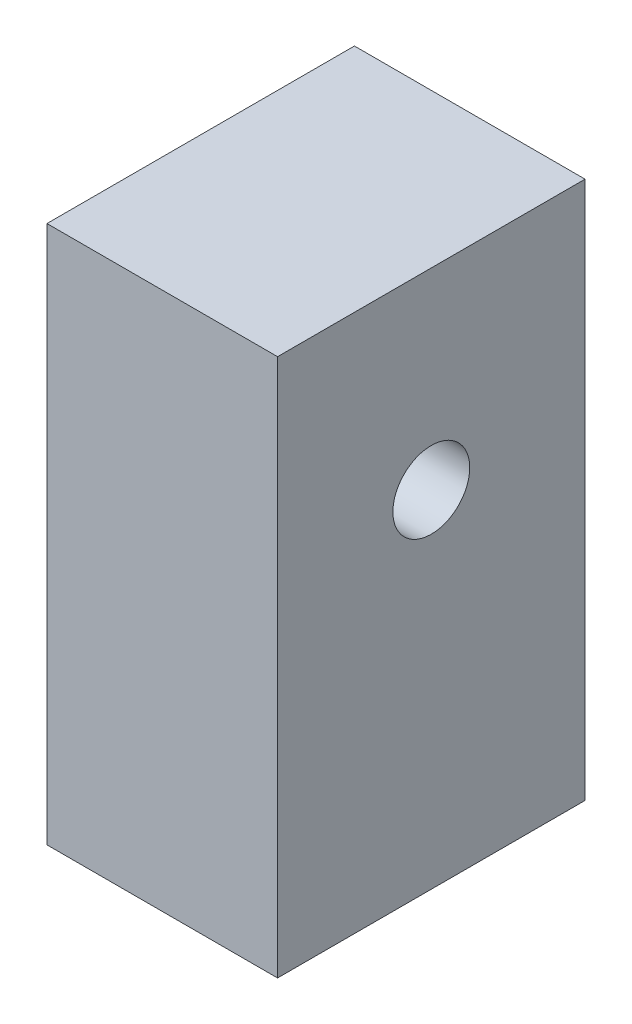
ISO-10303-21;
HEADER;
FILE_DESCRIPTION(('STEP AP214'),'2;1');
FILE_NAME('part.step','',(''),(''),'','','');
FILE_SCHEMA(('AUTOMOTIVE_DESIGN { 1 0 10303 214 1 1 1 1 }'));
ENDSEC;
DATA;
#1=APPLICATION_CONTEXT('core data for automotive mechanical design processes');
#2=APPLICATION_PROTOCOL_DEFINITION('international standard','automotive_design',2000,#1);
#3=PRODUCT_CONTEXT('',#1,'mechanical');
#4=PRODUCT('Part','Part','',(#3));
#5=PRODUCT_RELATED_PRODUCT_CATEGORY('part','',(#4));
#6=PRODUCT_DEFINITION_FORMATION('','',#4);
#7=PRODUCT_DEFINITION_CONTEXT('part definition',#1,'design');
#8=PRODUCT_DEFINITION('design','',#6,#7);
#9=PRODUCT_DEFINITION_SHAPE('','',#8);
#10=(LENGTH_UNIT() NAMED_UNIT(*) SI_UNIT(.MILLI.,.METRE.));
#11=(NAMED_UNIT(*) PLANE_ANGLE_UNIT() SI_UNIT($,.RADIAN.));
#12=(NAMED_UNIT(*) SI_UNIT($,.STERADIAN.) SOLID_ANGLE_UNIT());
#13=UNCERTAINTY_MEASURE_WITH_UNIT(LENGTH_MEASURE(1.E-05),#10,'distance_accuracy_value','');
#14=(GEOMETRIC_REPRESENTATION_CONTEXT(3) GLOBAL_UNCERTAINTY_ASSIGNED_CONTEXT((#13)) GLOBAL_UNIT_ASSIGNED_CONTEXT((#10,
#11,#12)) REPRESENTATION_CONTEXT('',''));
#15=CARTESIAN_POINT('',(0.,0.,0.));
#16=DIRECTION('',(0.,0.,1.));
#17=DIRECTION('',(1.,0.,0.));
#18=AXIS2_PLACEMENT_3D('',#15,#16,#17);
#19=CARTESIAN_POINT('',(9.525,22.225,-12.7));
#20=DIRECTION('',(0.,0.,1.));
#21=DIRECTION('',(0.,-1.,0.));
#22=AXIS2_PLACEMENT_3D('',#19,#20,#21);
#23=PLANE('',#22);
#24=DIRECTION('',(0.,1.,0.));
#25=VECTOR('',#24,1.);
#26=CARTESIAN_POINT('',(-9.525,22.225,-12.7));
#27=LINE('',#26,#25);
#28=CARTESIAN_POINT('',(-9.525,-22.225,-12.7));
#29=VERTEX_POINT('',#28);
#30=CARTESIAN_POINT('',(-9.525,22.225,-12.7));
#31=VERTEX_POINT('',#30);
#32=EDGE_CURVE('E118',#29,#31,#27,.T.);
#33=ORIENTED_EDGE('',*,*,#32,.T.);
#34=DIRECTION('',(-1.,0.,0.));
#35=VECTOR('',#34,1.);
#36=CARTESIAN_POINT('',(9.525,22.225,-12.7));
#37=LINE('',#36,#35);
#38=CARTESIAN_POINT('',(9.525,22.225,-12.7));
#39=VERTEX_POINT('',#38);
#40=EDGE_CURVE('E11',#39,#31,#37,.T.);
#41=ORIENTED_EDGE('',*,*,#40,.F.);
#42=DIRECTION('',(0.,1.,0.));
#43=VECTOR('',#42,1.);
#44=CARTESIAN_POINT('',(9.525,22.225,-12.7));
#45=LINE('',#44,#43);
#46=CARTESIAN_POINT('',(9.525,-22.225,-12.7));
#47=VERTEX_POINT('',#46);
#48=EDGE_CURVE('E119',#47,#39,#45,.T.);
#49=ORIENTED_EDGE('',*,*,#48,.F.);
#50=DIRECTION('',(-1.,0.,0.));
#51=VECTOR('',#50,1.);
#52=CARTESIAN_POINT('',(9.525,-22.225,-12.7));
#53=LINE('',#52,#51);
#54=EDGE_CURVE('E125',#47,#29,#53,.T.);
#55=ORIENTED_EDGE('',*,*,#54,.T.);
#56=EDGE_LOOP('',(#33,#41,#49,#55));
#57=FACE_BOUND('',#56,.T.);
#58=ADVANCED_FACE('F37',(#57),#23,.F.);
#59=CARTESIAN_POINT('',(9.525,22.225,12.7));
#60=DIRECTION('',(0.,-1.,0.));
#61=DIRECTION('',(0.,0.,-1.));
#62=AXIS2_PLACEMENT_3D('',#59,#60,#61);
#63=PLANE('',#62);
#64=DIRECTION('',(0.,0.,1.));
#65=VECTOR('',#64,1.);
#66=CARTESIAN_POINT('',(-9.525,22.225,12.7));
#67=LINE('',#66,#65);
#68=CARTESIAN_POINT('',(-9.525,22.225,12.7));
#69=VERTEX_POINT('',#68);
#70=EDGE_CURVE('E128',#31,#69,#67,.T.);
#71=ORIENTED_EDGE('',*,*,#70,.T.);
#72=DIRECTION('',(-1.,0.,0.));
#73=VECTOR('',#72,1.);
#74=CARTESIAN_POINT('',(9.525,22.225,12.7));
#75=LINE('',#74,#73);
#76=CARTESIAN_POINT('',(9.525,22.225,12.7));
#77=VERTEX_POINT('',#76);
#78=EDGE_CURVE('E45',#77,#69,#75,.T.);
#79=ORIENTED_EDGE('',*,*,#78,.F.);
#80=DIRECTION('',(0.,0.,1.));
#81=VECTOR('',#80,1.);
#82=CARTESIAN_POINT('',(9.525,22.225,12.7));
#83=LINE('',#82,#81);
#84=EDGE_CURVE('E84',#39,#77,#83,.T.);
#85=ORIENTED_EDGE('',*,*,#84,.F.);
#86=ORIENTED_EDGE('',*,*,#40,.T.);
#87=EDGE_LOOP('',(#71,#79,#85,#86));
#88=FACE_BOUND('',#87,.T.);
#89=ADVANCED_FACE('F155',(#88),#63,.F.);
#90=CARTESIAN_POINT('',(9.525,22.225,12.7));
#91=DIRECTION('',(0.,0.,-1.));
#92=DIRECTION('',(0.,1.,0.));
#93=AXIS2_PLACEMENT_3D('',#90,#91,#92);
#94=PLANE('',#93);
#95=DIRECTION('',(0.,-1.,0.));
#96=VECTOR('',#95,1.);
#97=CARTESIAN_POINT('',(-9.525,22.225,12.7));
#98=LINE('',#97,#96);
#99=CARTESIAN_POINT('',(-9.525,-22.225,12.7));
#100=VERTEX_POINT('',#99);
#101=EDGE_CURVE('E71',#69,#100,#98,.T.);
#102=ORIENTED_EDGE('',*,*,#101,.T.);
#103=DIRECTION('',(-1.,0.,0.));
#104=VECTOR('',#103,1.);
#105=CARTESIAN_POINT('',(9.525,-22.225,12.7));
#106=LINE('',#105,#104);
#107=CARTESIAN_POINT('',(9.525,-22.225,12.7));
#108=VERTEX_POINT('',#107);
#109=EDGE_CURVE('E133',#108,#100,#106,.T.);
#110=ORIENTED_EDGE('',*,*,#109,.F.);
#111=DIRECTION('',(0.,-1.,0.));
#112=VECTOR('',#111,1.);
#113=CARTESIAN_POINT('',(9.525,22.225,12.7));
#114=LINE('',#113,#112);
#115=EDGE_CURVE('E122',#77,#108,#114,.T.);
#116=ORIENTED_EDGE('',*,*,#115,.F.);
#117=ORIENTED_EDGE('',*,*,#78,.T.);
#118=EDGE_LOOP('',(#102,#110,#116,#117));
#119=FACE_BOUND('',#118,.T.);
#120=ADVANCED_FACE('F135',(#119),#94,.F.);
#121=CARTESIAN_POINT('',(9.525,-22.225,12.7));
#122=DIRECTION('',(0.,1.,0.));
#123=DIRECTION('',(0.,0.,1.));
#124=AXIS2_PLACEMENT_3D('',#121,#122,#123);
#125=PLANE('',#124);
#126=CARTESIAN_POINT('',(0.,-22.225,7.62));
#127=DIRECTION('',(0.,-1.,0.));
#128=DIRECTION('',(0.,0.,-1.));
#129=AXIS2_PLACEMENT_3D('',#126,#127,#128);
#130=CIRCLE('',#129,2.0193);
#131=CARTESIAN_POINT('',(0.,-22.225,5.6007));
#132=VERTEX_POINT('',#131);
#133=EDGE_CURVE('E102',#132,#132,#130,.T.);
#134=ORIENTED_EDGE('',*,*,#133,.F.);
#135=EDGE_LOOP('',(#134));
#136=FACE_BOUND('',#135,.T.);
#137=CARTESIAN_POINT('',(0.,-22.225,-7.62));
#138=DIRECTION('',(0.,-1.,0.));
#139=DIRECTION('',(0.,0.,-1.));
#140=AXIS2_PLACEMENT_3D('',#137,#138,#139);
#141=CIRCLE('',#140,2.0193);
#142=CARTESIAN_POINT('',(0.,-22.225,-9.6393));
#143=VERTEX_POINT('',#142);
#144=EDGE_CURVE('E101',#143,#143,#141,.T.);
#145=ORIENTED_EDGE('',*,*,#144,.F.);
#146=EDGE_LOOP('',(#145));
#147=FACE_BOUND('',#146,.T.);
#148=DIRECTION('',(0.,0.,-1.));
#149=VECTOR('',#148,1.);
#150=CARTESIAN_POINT('',(-9.525,-22.225,12.7));
#151=LINE('',#150,#149);
#152=EDGE_CURVE('E77',#100,#29,#151,.T.);
#153=ORIENTED_EDGE('',*,*,#152,.T.);
#154=ORIENTED_EDGE('',*,*,#54,.F.);
#155=DIRECTION('',(0.,0.,-1.));
#156=VECTOR('',#155,1.);
#157=CARTESIAN_POINT('',(9.525,-22.225,12.7));
#158=LINE('',#157,#156);
#159=EDGE_CURVE('E53',#108,#47,#158,.T.);
#160=ORIENTED_EDGE('',*,*,#159,.F.);
#161=ORIENTED_EDGE('',*,*,#109,.T.);
#162=EDGE_LOOP('',(#153,#154,#160,#161));
#163=FACE_BOUND('',#162,.T.);
#164=ADVANCED_FACE('F142',(#136,#147,#163),#125,.F.);
#165=CARTESIAN_POINT('',(9.525,0.,0.));
#166=DIRECTION('',(1.,0.,0.));
#167=DIRECTION('',(0.,0.,-1.));
#168=AXIS2_PLACEMENT_3D('',#165,#166,#167);
#169=PLANE('',#168);
#170=CARTESIAN_POINT('',(9.525,6.34999999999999,0.));
#171=DIRECTION('',(1.,0.,0.));
#172=DIRECTION('',(0.,0.,-1.));
#173=AXIS2_PLACEMENT_3D('',#170,#171,#172);
#174=CIRCLE('',#173,3.17499999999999);
#175=CARTESIAN_POINT('',(9.525,6.34999999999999,-3.17499999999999));
#176=VERTEX_POINT('',#175);
#177=EDGE_CURVE('E112',#176,#176,#174,.T.);
#178=ORIENTED_EDGE('',*,*,#177,.F.);
#179=EDGE_LOOP('',(#178));
#180=FACE_BOUND('',#179,.T.);
#181=ORIENTED_EDGE('',*,*,#48,.T.);
#182=ORIENTED_EDGE('',*,*,#84,.T.);
#183=ORIENTED_EDGE('',*,*,#115,.T.);
#184=ORIENTED_EDGE('',*,*,#159,.T.);
#185=EDGE_LOOP('',(#181,#182,#183,#184));
#186=FACE_BOUND('',#185,.T.);
#187=ADVANCED_FACE('F144',(#180,#186),#169,.T.);
#188=CARTESIAN_POINT('',(-9.525,0.,0.));
#189=DIRECTION('',(1.,0.,0.));
#190=DIRECTION('',(0.,0.,-1.));
#191=AXIS2_PLACEMENT_3D('',#188,#189,#190);
#192=PLANE('',#191);
#193=CARTESIAN_POINT('',(-9.525,6.34999999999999,0.));
#194=DIRECTION('',(1.,0.,0.));
#195=DIRECTION('',(0.,0.,-1.));
#196=AXIS2_PLACEMENT_3D('',#193,#194,#195);
#197=CIRCLE('',#196,3.175);
#198=CARTESIAN_POINT('',(-9.525,6.34999999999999,-3.175));
#199=VERTEX_POINT('',#198);
#200=EDGE_CURVE('E115',#199,#199,#197,.T.);
#201=ORIENTED_EDGE('',*,*,#200,.T.);
#202=EDGE_LOOP('',(#201));
#203=FACE_BOUND('',#202,.T.);
#204=ORIENTED_EDGE('',*,*,#32,.F.);
#205=ORIENTED_EDGE('',*,*,#152,.F.);
#206=ORIENTED_EDGE('',*,*,#101,.F.);
#207=ORIENTED_EDGE('',*,*,#70,.F.);
#208=EDGE_LOOP('',(#204,#205,#206,#207));
#209=FACE_BOUND('',#208,.T.);
#210=ADVANCED_FACE('F138',(#203,#209),#192,.F.);
#211=CARTESIAN_POINT('',(9.525,6.34999999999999,0.));
#212=DIRECTION('',(1.,0.,0.));
#213=DIRECTION('',(0.,0.,-1.));
#214=AXIS2_PLACEMENT_3D('',#211,#212,#213);
#215=CYLINDRICAL_SURFACE('',#214,3.17499999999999);
#216=ORIENTED_EDGE('',*,*,#200,.F.);
#217=EDGE_LOOP('',(#216));
#218=FACE_BOUND('',#217,.T.);
#219=ORIENTED_EDGE('',*,*,#177,.T.);
#220=EDGE_LOOP('',(#219));
#221=FACE_BOUND('',#220,.T.);
#222=ADVANCED_FACE('F187',(#218,#221),#215,.F.);
#223=CARTESIAN_POINT('',(0.,-10.1854,-7.62));
#224=DIRECTION('',(0.,-1.,0.));
#225=DIRECTION('',(0.,0.,-1.));
#226=AXIS2_PLACEMENT_3D('',#223,#224,#225);
#227=CONICAL_SURFACE('',#226,2.01929999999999,1.02974425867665);
#228=CARTESIAN_POINT('',(0.,-8.97208215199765,-7.62));
#229=VERTEX_POINT('',#228);
#230=VERTEX_LOOP('',#229);
#231=FACE_BOUND('',#230,.T.);
#232=CARTESIAN_POINT('',(0.,-10.1854,-7.62));
#233=DIRECTION('',(0.,-1.,0.));
#234=DIRECTION('',(0.,0.,-1.));
#235=AXIS2_PLACEMENT_3D('',#232,#233,#234);
#236=CIRCLE('',#235,2.01929999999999);
#237=CARTESIAN_POINT('',(0.,-10.1854,-9.6393));
#238=VERTEX_POINT('',#237);
#239=EDGE_CURVE('E105',#238,#238,#236,.T.);
#240=ORIENTED_EDGE('',*,*,#239,.T.);
#241=EDGE_LOOP('',(#240));
#242=FACE_BOUND('',#241,.T.);
#243=ADVANCED_FACE('F195',(#231,#242),#227,.F.);
#244=CARTESIAN_POINT('',(0.,-22.225,-7.62));
#245=DIRECTION('',(0.,-1.,0.));
#246=DIRECTION('',(0.,0.,-1.));
#247=AXIS2_PLACEMENT_3D('',#244,#245,#246);
#248=CYLINDRICAL_SURFACE('',#247,2.0193);
#249=ORIENTED_EDGE('',*,*,#239,.F.);
#250=EDGE_LOOP('',(#249));
#251=FACE_BOUND('',#250,.T.);
#252=ORIENTED_EDGE('',*,*,#144,.T.);
#253=EDGE_LOOP('',(#252));
#254=FACE_BOUND('',#253,.T.);
#255=ADVANCED_FACE('F95',(#251,#254),#248,.F.);
#256=CARTESIAN_POINT('',(0.,-10.1854,7.62));
#257=DIRECTION('',(0.,-1.,0.));
#258=DIRECTION('',(0.,0.,-1.));
#259=AXIS2_PLACEMENT_3D('',#256,#257,#258);
#260=CONICAL_SURFACE('',#259,2.01929999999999,1.02974425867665);
#261=CARTESIAN_POINT('',(0.,-8.97208215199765,7.62));
#262=VERTEX_POINT('',#261);
#263=VERTEX_LOOP('',#262);
#264=FACE_BOUND('',#263,.T.);
#265=CARTESIAN_POINT('',(0.,-10.1854,7.62));
#266=DIRECTION('',(0.,-1.,0.));
#267=DIRECTION('',(0.,0.,-1.));
#268=AXIS2_PLACEMENT_3D('',#265,#266,#267);
#269=CIRCLE('',#268,2.01929999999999);
#270=CARTESIAN_POINT('',(0.,-10.1854,5.6007));
#271=VERTEX_POINT('',#270);
#272=EDGE_CURVE('E99',#271,#271,#269,.T.);
#273=ORIENTED_EDGE('',*,*,#272,.T.);
#274=EDGE_LOOP('',(#273));
#275=FACE_BOUND('',#274,.T.);
#276=ADVANCED_FACE('F91',(#264,#275),#260,.F.);
#277=CARTESIAN_POINT('',(0.,-22.225,7.62));
#278=DIRECTION('',(0.,-1.,0.));
#279=DIRECTION('',(0.,0.,-1.));
#280=AXIS2_PLACEMENT_3D('',#277,#278,#279);
#281=CYLINDRICAL_SURFACE('',#280,2.0193);
#282=ORIENTED_EDGE('',*,*,#272,.F.);
#283=EDGE_LOOP('',(#282));
#284=FACE_BOUND('',#283,.T.);
#285=ORIENTED_EDGE('',*,*,#133,.T.);
#286=EDGE_LOOP('',(#285));
#287=FACE_BOUND('',#286,.T.);
#288=ADVANCED_FACE('F94',(#284,#287),#281,.F.);
#289=CLOSED_SHELL('',(#58,#89,#120,#164,#187,#210,#222,#243,#255,#276,#288));
#290=MANIFOLD_SOLID_BREP('B2',#289);
#291=ADVANCED_BREP_SHAPE_REPRESENTATION('',(#18,#290),#14);
#292=SHAPE_DEFINITION_REPRESENTATION(#9,#291);
ENDSEC;
END-ISO-10303-21;
